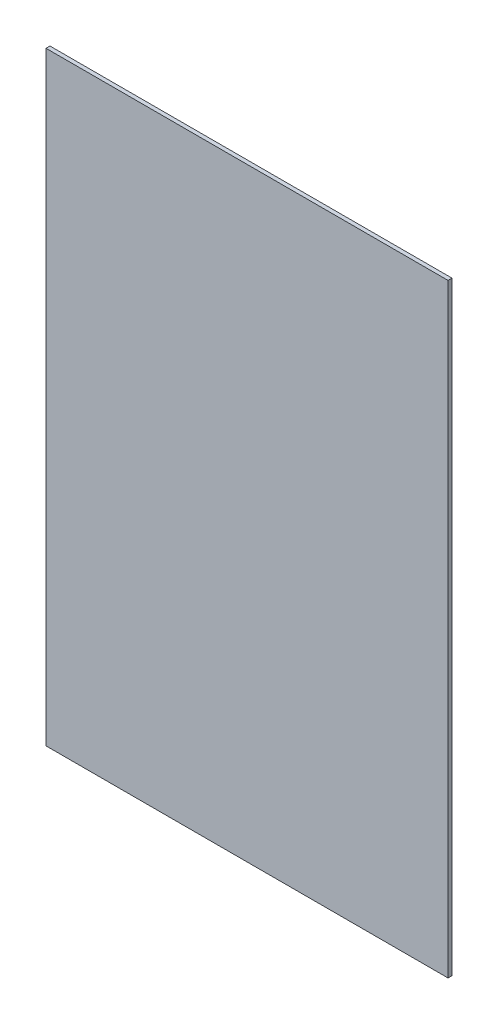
from build123d import *

# Parameters (mm, degrees)
ESBO_O1_W                = 1830
ESBO_O1_H                = 2750
RESSALTO_EXTRUS_O1_DEPTH = 18


with BuildPart() as part:
    # Esbo_o1 → Ressalto-extrus_o1 (new body)
    with BuildSketch(Plane.XY):
        with Locations((-915, 1375)):
            Rectangle(ESBO_O1_W, ESBO_O1_H)
    extrude(amount=RESSALTO_EXTRUS_O1_DEPTH)


solid = part.part
